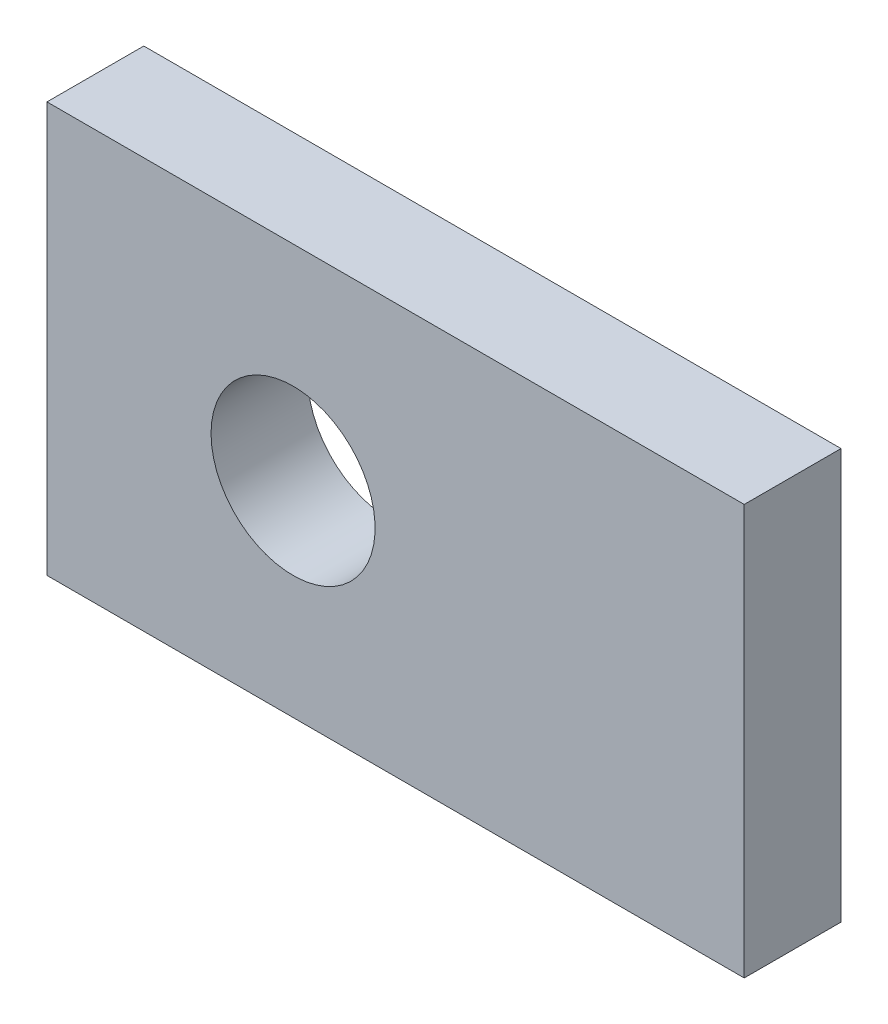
from build123d import *

# Parameters (mm, degrees)
SKETCH1_W           = 21.59
SKETCH1_H           = 12.7
SKETCH1_R           = 2.54
BOSS_EXTRUDE1_DEPTH = 2.9972


with BuildPart() as part:
    # Sketch1 → Boss-Extrude1 (new body)
    with BuildSketch(Plane.XY):
        with Locations((10.795, 6.35)):
            Rectangle(SKETCH1_W, SKETCH1_H)
        with Locations(Location((7.62, 6.35, 0), (0, 0, 180))):
            Circle(SKETCH1_R, mode=Mode.SUBTRACT)
    extrude(amount=BOSS_EXTRUDE1_DEPTH)


solid = part.part
